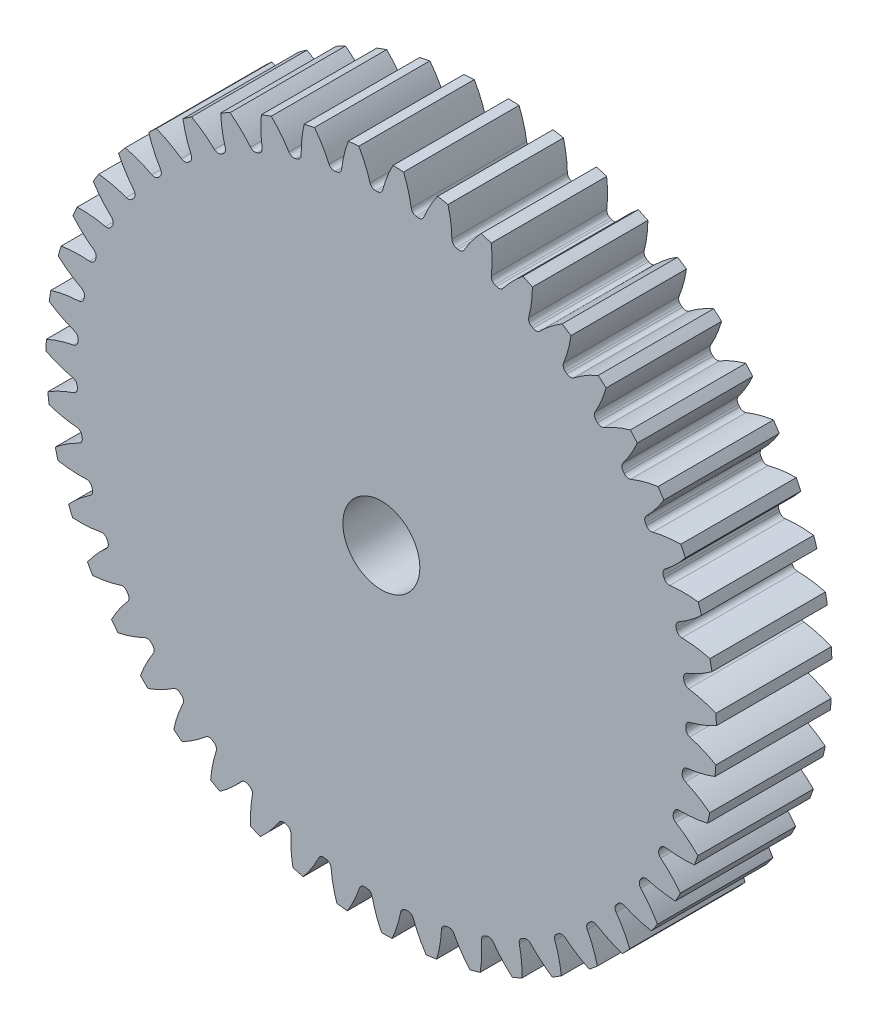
from build123d import *

# Parameters (mm, degrees)
SKETCH3_R         = 276.577777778
GEARBODY_DEPTH    = 95.25
TOOTHCUT_DEPTH    = 403.570610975
CIRPATTERN1_COUNT = 47
BOREDIA_R         = 31.75
BORE_DEPTH        = 12700


with BuildPart() as part:
    # Sketch3 → gearBody (new body)
    with BuildSketch(Plane.XY):
        Circle(SKETCH3_R)
    extrude(amount=GEARBODY_DEPTH)

    # Sketch2 → toothCut (cut, through all)
    with BuildSketch(Plane.XY):
        with BuildLine():
            ThreePointArc((251.125254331, -5.136407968), (251.140444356, -4.330503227), (251.153048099, -3.524553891))
            ThreePointArc((251.153048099, -3.524553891), (252.136358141, -0.747871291), (254.60381513, 0.861016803))
            ThreePointArc((254.60381513, 0.861016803), (265.851283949, 4.489558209), (276.577777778, 9.450827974))
            ThreePointArc((276.577777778, 9.450827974), (276.698068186, -4.771202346), (276.087524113, -18.98063063))
            ThreePointArc((276.087524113, -18.98063063), (265.538454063, -13.652498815), (254.42277099, -9.638341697))
            ThreePointArc((254.42277099, -9.638341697), (252.012249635, -7.945340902), (251.125254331, -5.136407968))
        make_face()
    toothcut = extrude(amount=TOOTHCUT_DEPTH, mode=Mode.SUBTRACT)

    # CirPattern1: toothCut ×47 about axis
    cirpattern1_axis = Axis((0, 0, 0), (0, 0, 1))
    for i in range(1, CIRPATTERN1_COUNT):
        add(toothcut.rotate(cirpattern1_axis, i * 360 / CIRPATTERN1_COUNT), mode=Mode.SUBTRACT)

    # boreDia → bore (cut, symmetric)
    with BuildSketch(Plane.XY):
        Circle(BOREDIA_R)
    extrude(amount=BORE_DEPTH, both=True, mode=Mode.SUBTRACT)


solid = part.part
